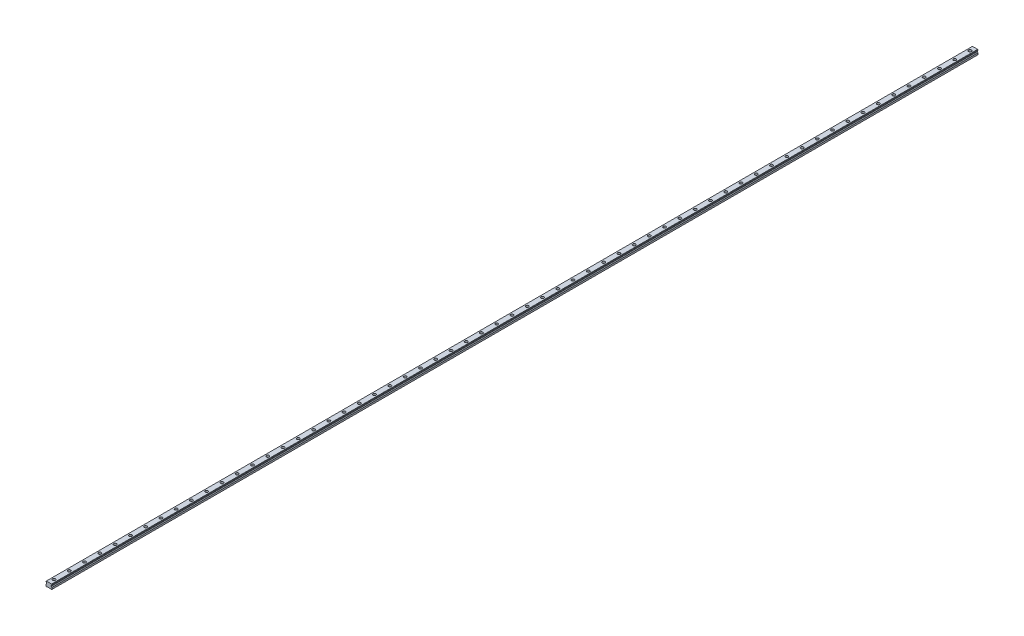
from build123d import *

# Parameters (mm, degrees)
SKETCH1_W           = 23
SKETCH1_H           = 19.2
BOSS_EXTRUDE1_DEPTH = 1820
CUT_EXTRUDE1_DEPTH  = 3641.068802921
CHAMFER1_SIZE       = 1.25
FILLET1_R           = 1.25
CUT_EXTRUDE2_DEPTH  = 3641.068802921
SKETCH4_R           = 5.5
SKETCH4_R_2         = 3.5
CUT_EXTRUDE3_DEPTH  = 9
SKETCH4_2_R         = 3.5
CUT_EXTRUDE4_DEPTH  = 1821.137601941
LPATTERN1_COUNT     = 61
LPATTERN1_PITCH     = 60


with BuildPart() as part:
    # Sketch1 → Boss-Extrude1 (new, symmetric)
    with BuildSketch(Plane.XY):
        with Locations((0, 9.6)):
            Rectangle(SKETCH1_W, SKETCH1_H)
    extrude(amount=BOSS_EXTRUDE1_DEPTH, both=True)

    # Sketch2 → Cut-Extrude1 (cut, through all)
    with BuildSketch(Plane.XY.offset(1820)):
        Polygon((-11.5, 16.7), (-11.5, 7.95), (-8.583333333, 10.866666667), (-8.583333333, 13.783333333), align=None)
        Polygon((8.583333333, 13.783333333), (11.5, 16.7), (11.5, 7.95), (8.583333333, 10.866666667), align=None)
    extrude(amount=-CUT_EXTRUDE1_DEPTH, mode=Mode.SUBTRACT)

    # Chamfer1
    chamfer1_edges = [part.edges().sort_by_distance(p)[0] for p in [
        (-11.5, 19.2, 0),
        (11.5, 19.2, 0),
        (11.5, 0, 0),
        (-11.5, 0, 0),
    ]]
    chamfer(chamfer1_edges, length=CHAMFER1_SIZE)

    # Fillet1
    fillet1_edges = [part.edges().sort_by_distance(p)[0] for p in [
        (-8.583333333, 13.783333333, 0),
        (-8.583333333, 10.866666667, 0),
        (8.583333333, 10.866666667, 0),
        (8.583333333, 13.783333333, 0),
    ]]
    fillet(fillet1_edges, radius=FILLET1_R)

    # Sketch3 → Cut-Extrude2 (cut, through all)
    with BuildSketch(Plane.XY.offset(1820)):
        Polygon((-7, 0), (-5.75, 1.25), (5.75, 1.25), (7, 0), align=None)
    extrude(amount=-CUT_EXTRUDE2_DEPTH, mode=Mode.SUBTRACT)

    # Sketch4 → Cut-Extrude3 (cut)
    with BuildSketch(Plane(origin=(0, 19.2, 0), x_dir=(1, 0, 0), z_dir=(0, 1, 0))):
        with Locations(Location((0, -1800, 0), (0, 0, 270))):
            Circle(SKETCH4_R)
        with Locations(Location((0, -1800, 0), (0, 0, 270))):
            Circle(SKETCH4_R_2, mode=Mode.SUBTRACT)
    cut_extrude3 = extrude(amount=-CUT_EXTRUDE3_DEPTH, mode=Mode.SUBTRACT)

    # Sketch4_2 → Cut-Extrude4 (cut, through all)
    with BuildSketch(Plane(origin=(0, 19.2, 0), x_dir=(1, 0, 0), z_dir=(0, 1, 0))):
        with Locations(Location((0, -1800, 0), (0, 0, 270))):
            Circle(SKETCH4_2_R)
    cut_extrude4 = extrude(amount=-CUT_EXTRUDE4_DEPTH, mode=Mode.SUBTRACT)

    # LPattern1: Cut-Extrude3, Cut-Extrude4 ×61
    with Locations(*[(0, 0, -i * LPATTERN1_PITCH) for i in range(1, LPATTERN1_COUNT)]):
        add(cut_extrude3, mode=Mode.SUBTRACT)
        add(cut_extrude4, mode=Mode.SUBTRACT)


solid = part.part
